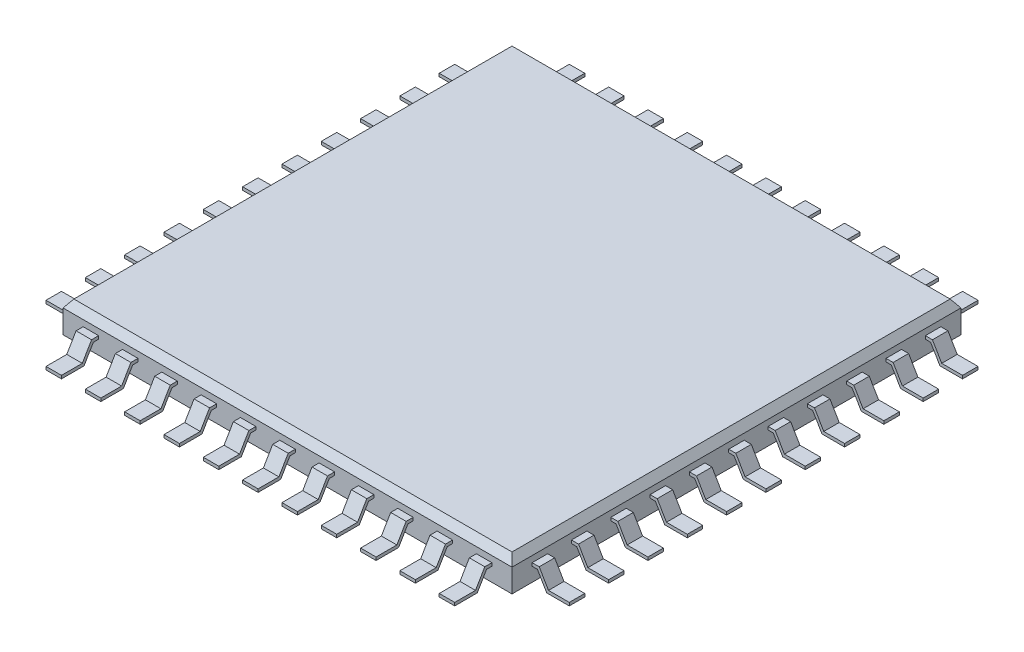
from build123d import *
from OCP.BRepFilletAPI import BRepFilletAPI_MakeChamfer

# Parameters (mm, degrees)
SKETCH1_W             = 14.5
SKETCH1_H             = 14.5
EXTRUDE1_DEPTH        = 0.5
CHAMFER1_SIZE         = 0.25
CHAMFER1_SIZE2        = 0.175051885
EXTRUDE_THIN1_DEPTH   = 0.25
LPATTERN1_COUNT       = 6
LPATTERN1_PITCH       = 1.27
LPATTERN1_COL_COUNT   = 6
LPATTERN1_COL_PITCH   = 1.27
MIRROR1_COPY_1_DEPTH  = 0.25
MIRROR1_COPY_2_DEPTH  = 0.25
MIRROR1_COPY_3_DEPTH  = 0.25
MIRROR1_COPY_4_DEPTH  = 0.25
MIRROR1_COPY_5_DEPTH  = 0.25
MIRROR1_COPY_6_DEPTH  = 0.25
MIRROR1_COPY_7_DEPTH  = 0.25
MIRROR1_COPY_8_DEPTH  = 0.25
MIRROR1_COPY_9_DEPTH  = 0.25
MIRROR1_COPY_10_DEPTH = 0.25
BODY_MOVE_COPY1_ANGLE = 90


with BuildPart() as part:
    # Sketch1 → Extrude1 (new, symmetric)
    with BuildSketch(Plane(origin=(0, 0, 0), x_dir=(1, 0, 0), z_dir=(0, 1, 0))):
        Rectangle(SKETCH1_W, SKETCH1_H)
    extrude(amount=EXTRUDE1_DEPTH, both=True)

    # Chamfer1: one chamfer whose edges measure the first distance from different faces: ONE call of the kernel's chamfer builder (chamfer() names one face for all edges)
    chamfer1_edges_1 = [part.edges().sort_by_distance(p)[0] for p in [
        (7.25, 0.5, 0),
    ]]
    chamfer1_side_1 = [part.faces().sort_by_distance(p)[0] for p in [
        (7.25, 0, 0),
    ]]
    chamfer1_edges_2 = [part.edges().sort_by_distance(p)[0] for p in [
        (0, 0.5, -7.25),
    ]]
    chamfer1_side_2 = [part.faces().sort_by_distance(p)[0] for p in [
        (0, 0, -7.25),
    ]]
    chamfer1_edges_3 = [part.edges().sort_by_distance(p)[0] for p in [
        (-7.25, 0.5, 0),
    ]]
    chamfer1_side_3 = [part.faces().sort_by_distance(p)[0] for p in [
        (-7.25, 0, 0),
    ]]
    chamfer1_edges_4 = [part.edges().sort_by_distance(p)[0] for p in [
        (0, 0.5, 7.25),
    ]]
    chamfer1_side_4 = [part.faces().sort_by_distance(p)[0] for p in [
        (0, 0, 7.25),
    ]]
    chamfer1 = BRepFilletAPI_MakeChamfer(part.part.solid().wrapped)
    for e in chamfer1_edges_1:
        chamfer1.Add(CHAMFER1_SIZE, CHAMFER1_SIZE2, e.wrapped, chamfer1_side_1[0].wrapped)  # the first distance lies on this face
    for e in chamfer1_edges_2:
        chamfer1.Add(CHAMFER1_SIZE, CHAMFER1_SIZE2, e.wrapped, chamfer1_side_2[0].wrapped)  # the first distance lies on this face
    for e in chamfer1_edges_3:
        chamfer1.Add(CHAMFER1_SIZE, CHAMFER1_SIZE2, e.wrapped, chamfer1_side_3[0].wrapped)  # the first distance lies on this face
    for e in chamfer1_edges_4:
        chamfer1.Add(CHAMFER1_SIZE, CHAMFER1_SIZE2, e.wrapped, chamfer1_side_4[0].wrapped)  # the first distance lies on this face
    add(Compound.cast(chamfer1.Shape()), mode=Mode.REPLACE)

    # Sketch4 → Extrude-Thin1 (add, symmetric)
    with BuildSketch(Plane.XY):
        Polygon((-7.25, 0.05), (-7.478597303, 0.05), (-7.778597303, -0.46), (-8.45, -0.46), (-8.45, -0.56), (-7.721402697, -0.56), (-7.421402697, -0.05), (-7.25, -0.05), align=None)
    extrude_thin1 = extrude(amount=EXTRUDE_THIN1_DEPTH, both=True)

    # LPattern1: Extrude-Thin1 ×6
    with Locations(*[(0, 0, -i * LPATTERN1_PITCH) for i in range(1, LPATTERN1_COUNT)]):
        add(extrude_thin1)

    # LPattern1 col: Extrude-Thin1 ×6
    with Locations(*[(0, 0, i * LPATTERN1_COL_PITCH) for i in range(1, LPATTERN1_COL_COUNT)]):
        add(extrude_thin1)

    # Mirror1: Extrude-Thin1 across plane
    add(extrude_thin1.mirror(Plane(origin=(0, 0, 0), x_dir=(0, 0, 1), z_dir=(1, 0, 0))))

    # Mirror1 copy 1 sketch → Mirror1 copy 1 (add, symmetric)
    with BuildSketch(Plane(origin=(0, 0, -1.27), x_dir=(-1, 0, 0), z_dir=(0, 0, 1))):
        Polygon((-7.25, -0.05), (-7.478597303, -0.05), (-7.778597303, 0.46), (-8.45, 0.46), (-8.45, 0.56), (-7.721402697, 0.56), (-7.421402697, 0.05), (-7.25, 0.05), align=None)
    extrude(amount=MIRROR1_COPY_1_DEPTH, both=True)

    # Mirror1 copy 2 sketch → Mirror1 copy 2 (add, symmetric)
    with BuildSketch(Plane(origin=(0, 0, -2.54), x_dir=(-1, 0, 0), z_dir=(0, 0, 1))):
        Polygon((-7.25, -0.05), (-7.478597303, -0.05), (-7.778597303, 0.46), (-8.45, 0.46), (-8.45, 0.56), (-7.721402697, 0.56), (-7.421402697, 0.05), (-7.25, 0.05), align=None)
    extrude(amount=MIRROR1_COPY_2_DEPTH, both=True)

    # Mirror1 copy 3 sketch → Mirror1 copy 3 (add, symmetric)
    with BuildSketch(Plane(origin=(0, 0, -3.81), x_dir=(-1, 0, 0), z_dir=(0, 0, 1))):
        Polygon((-7.25, -0.05), (-7.478597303, -0.05), (-7.778597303, 0.46), (-8.45, 0.46), (-8.45, 0.56), (-7.721402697, 0.56), (-7.421402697, 0.05), (-7.25, 0.05), align=None)
    extrude(amount=MIRROR1_COPY_3_DEPTH, both=True)

    # Mirror1 copy 4 sketch → Mirror1 copy 4 (add, symmetric)
    with BuildSketch(Plane(origin=(0, 0, -5.08), x_dir=(-1, 0, 0), z_dir=(0, 0, 1))):
        Polygon((-7.25, -0.05), (-7.478597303, -0.05), (-7.778597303, 0.46), (-8.45, 0.46), (-8.45, 0.56), (-7.721402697, 0.56), (-7.421402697, 0.05), (-7.25, 0.05), align=None)
    extrude(amount=MIRROR1_COPY_4_DEPTH, both=True)

    # Mirror1 copy 5 sketch → Mirror1 copy 5 (add, symmetric)
    with BuildSketch(Plane(origin=(0, 0, -6.35), x_dir=(-1, 0, 0), z_dir=(0, 0, 1))):
        Polygon((-7.25, -0.05), (-7.478597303, -0.05), (-7.778597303, 0.46), (-8.45, 0.46), (-8.45, 0.56), (-7.721402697, 0.56), (-7.421402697, 0.05), (-7.25, 0.05), align=None)
    extrude(amount=MIRROR1_COPY_5_DEPTH, both=True)

    # Mirror1 copy 6 sketch → Mirror1 copy 6 (add, symmetric)
    with BuildSketch(Plane(origin=(0, 0, 1.27), x_dir=(-1, 0, 0), z_dir=(0, 0, 1))):
        Polygon((-7.25, -0.05), (-7.478597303, -0.05), (-7.778597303, 0.46), (-8.45, 0.46), (-8.45, 0.56), (-7.721402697, 0.56), (-7.421402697, 0.05), (-7.25, 0.05), align=None)
    extrude(amount=MIRROR1_COPY_6_DEPTH, both=True)

    # Mirror1 copy 7 sketch → Mirror1 copy 7 (add, symmetric)
    with BuildSketch(Plane(origin=(0, 0, 2.54), x_dir=(-1, 0, 0), z_dir=(0, 0, 1))):
        Polygon((-7.25, -0.05), (-7.478597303, -0.05), (-7.778597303, 0.46), (-8.45, 0.46), (-8.45, 0.56), (-7.721402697, 0.56), (-7.421402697, 0.05), (-7.25, 0.05), align=None)
    extrude(amount=MIRROR1_COPY_7_DEPTH, both=True)

    # Mirror1 copy 8 sketch → Mirror1 copy 8 (add, symmetric)
    with BuildSketch(Plane(origin=(0, 0, 3.81), x_dir=(-1, 0, 0), z_dir=(0, 0, 1))):
        Polygon((-7.25, -0.05), (-7.478597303, -0.05), (-7.778597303, 0.46), (-8.45, 0.46), (-8.45, 0.56), (-7.721402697, 0.56), (-7.421402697, 0.05), (-7.25, 0.05), align=None)
    extrude(amount=MIRROR1_COPY_8_DEPTH, both=True)

    # Mirror1 copy 9 sketch → Mirror1 copy 9 (add, symmetric)
    with BuildSketch(Plane(origin=(0, 0, 5.08), x_dir=(-1, 0, 0), z_dir=(0, 0, 1))):
        Polygon((-7.25, -0.05), (-7.478597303, -0.05), (-7.778597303, 0.46), (-8.45, 0.46), (-8.45, 0.56), (-7.721402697, 0.56), (-7.421402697, 0.05), (-7.25, 0.05), align=None)
    extrude(amount=MIRROR1_COPY_9_DEPTH, both=True)

    # Mirror1 copy 10 sketch → Mirror1 copy 10 (add, symmetric)
    with BuildSketch(Plane(origin=(0, 0, 6.35), x_dir=(-1, 0, 0), z_dir=(0, 0, 1))):
        Polygon((-7.25, -0.05), (-7.478597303, -0.05), (-7.778597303, 0.46), (-8.45, 0.46), (-8.45, 0.56), (-7.721402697, 0.56), (-7.421402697, 0.05), (-7.25, 0.05), align=None)
    extrude(amount=MIRROR1_COPY_10_DEPTH, both=True)


with BuildPart() as body_2:
    # Body-Move_Copy1: copy of part
    add(part.part.rotate(Axis((0, 0, 0), (0, 1, 0)), BODY_MOVE_COPY1_ANGLE))


with BuildPart() as part_1:
    add(part.part)

    # Combine1: union body 2
    add(body_2.part)


solid = part_1.part
